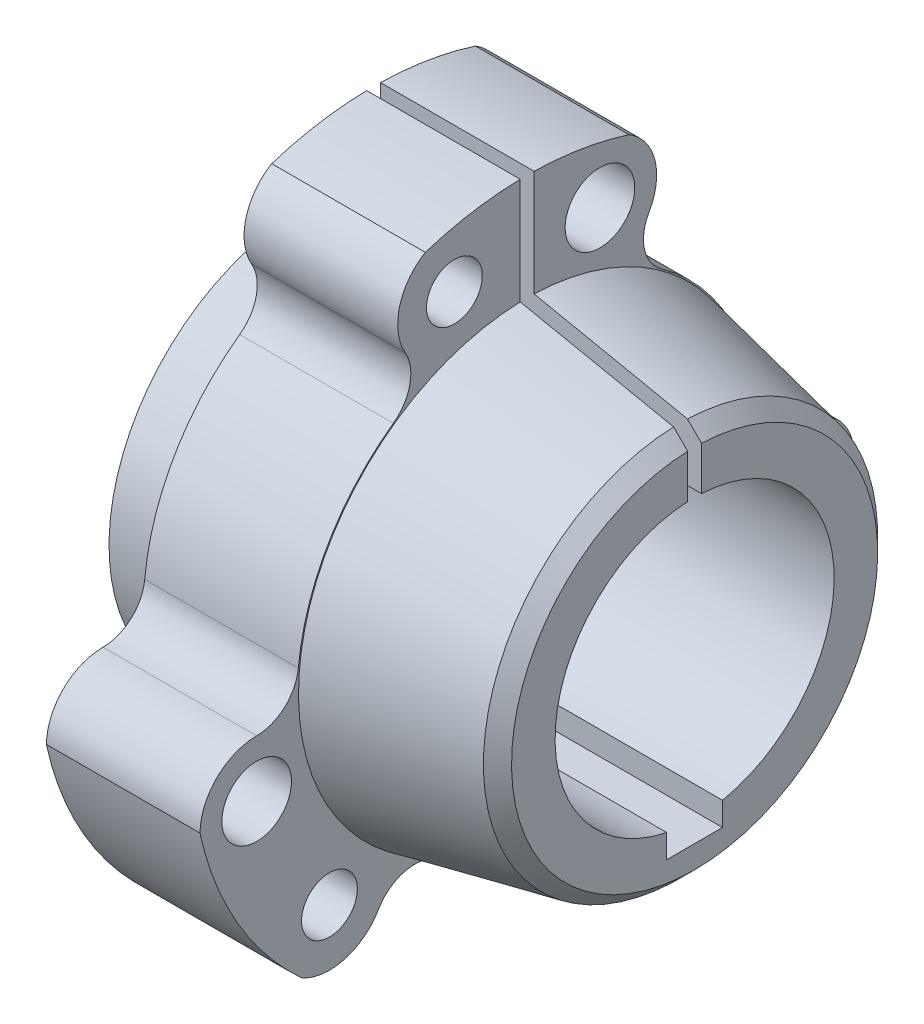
from build123d import *

# Parameters (mm, degrees)
SKETCH2_R                    = 3.9624
SKETCH2_R_2                  = 3.175
CUT_EXTRUDE1_DEPTH           = 50.8
CUT_EXTRUDE2_DEPTH           = 50.8
CIRPATTERN1_COUNT            = 3
CUT_EXTRUDE_THIN1_DEPTH      = 65.587496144
CUT_EXTRUDE_THIN1_DEPTH_BACK = 65.587496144
SKETCH4_W                    = 1.5748
SKETCH4_H                    = 49.565865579
SKETCH5_W                    = 6.35
SKETCH5_H                    = 5.08
CUT_EXTRUDE3_DEPTH           = 38.1
CHAMFER1_SIZE                = 1.27
CHAMFER1_SIZE2               = 1.632303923


with BuildPart() as part:
    # Sketch1 → Revolve1 (revolve)
    with BuildSketch(Plane.XY, mode=Mode.PRIVATE) as revolve1_sk:
        Polygon((-7.9248, 15.875), (36.5252, 15.875), (36.5252, 22.098), (17.4752, 26.016069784), (17.4752, 38.1), (0, 38.1), (0, 22.1742), (-7.9248, 22.1742), align=None)
    revolve(revolve1_sk.sketch.rotate(Axis((0, 0, 0), (1, 0, 0)), 90), axis=Axis((0, 0, 0), (1, 0, 0)))

    # Sketch2 → Cut-Extrude1 (cut)
    with BuildSketch(Plane(origin=(0, 0, 0), x_dir=(0, 0, -1), z_dir=(1, 0, 0))):
        with Locations(Location((8.2804, 30.756452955, 0), (0, 0, 180))):
            Circle(SKETCH2_R)
        with Locations(Location((22.49566959, -22.549263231, 0), (0, 0, 180))):
            Circle(SKETCH2_R)
        with Locations(Location((-30.77606959, -8.207189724, 0), (0, 0, 180))):
            Circle(SKETCH2_R)
        with Locations(Location((-8.2804, 30.756452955, 0), (0, 0, 180))):
            Circle(SKETCH2_R_2)
        with Locations(Location((-22.49566959, -22.549263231, 0), (0, 0, 180))):
            Circle(SKETCH2_R_2)
        with Locations(Location((30.77606959, -8.207189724, 0), (0, 0, 180))):
            Circle(SKETCH2_R_2)
    extrude(amount=CUT_EXTRUDE1_DEPTH, mode=Mode.SUBTRACT)

    # Sketch3 → Cut-Extrude2 (cut)
    with BuildSketch(Plane(origin=(0, 0, 0), x_dir=(0, 0, -1), z_dir=(1, 0, 0))):
        with BuildLine():
            ThreePointArc((15.22995753, 21.272015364), (22.656956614, 13.081), (26.03708446, 2.553522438))
            ThreePointArc((26.03708446, 2.553522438), (27.579809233, -0.516005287), (30.78377852, -1.75559433))
            ThreePointArc((30.78377852, -1.75559433), (35.894478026, -4.279717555), (37.009818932, -9.869571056))
            ThreePointArc((37.009818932, -9.869571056), (33.171544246, 19.1516), (9.957610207, 36.986228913))
            ThreePointArc((9.957610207, 36.986228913), (14.240894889, 33.225388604), (13.871499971, 27.537331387))
            ThreePointArc((13.871499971, 27.537331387), (13.343030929, 24.142818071), (15.22995753, 21.272015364))
        make_face()
    cut_extrude2 = extrude(amount=CUT_EXTRUDE2_DEPTH, mode=Mode.SUBTRACT)

    # CirPattern1: Cut-Extrude2 ×3 about axis
    cirpattern1_axis = Axis((0, 0, 0), (1, 0, 0))
    for i in range(1, CIRPATTERN1_COUNT):
        add(cut_extrude2.rotate(cirpattern1_axis, i * 360 / CIRPATTERN1_COUNT), mode=Mode.SUBTRACT)

    # Sketch4 → Cut-Extrude-Thin1 (cut, two sides: drawn at the far end of the back side and taken through both)
    with BuildSketch(Plane(origin=(0, 0, 0), x_dir=(0, 0, -1), z_dir=(1, 0, 0)).offset(-CUT_EXTRUDE_THIN1_DEPTH_BACK)):
        with Locations((0, 24.78293279)):
            Rectangle(SKETCH4_W, SKETCH4_H)
    extrude(amount=CUT_EXTRUDE_THIN1_DEPTH + CUT_EXTRUDE_THIN1_DEPTH_BACK, mode=Mode.SUBTRACT)

    # Sketch5 → Cut-Extrude3 (cut, symmetric)
    with BuildSketch(Plane(origin=(0, 0, 0), x_dir=(0, 0, -1), z_dir=(1, 0, 0))):
        with Locations((0, -15.6972)):
            Rectangle(SKETCH5_W, SKETCH5_H)
    extrude(amount=CUT_EXTRUDE3_DEPTH, both=True, mode=Mode.SUBTRACT)

    # Chamfer1
    chamfer1_edges = [part.edges().sort_by_distance(p)[0] for p in [
        (36.5252, -15.90159692, -15.344732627),
    ]]
    chamfer1_side = [part.faces().sort_by_distance(p)[0] for p in [
        (36.5252, 18.969713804, 1.412326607),
    ]]
    chamfer(chamfer1_edges, length=CHAMFER1_SIZE, length2=CHAMFER1_SIZE2, reference=chamfer1_side[0])


solid = part.part
